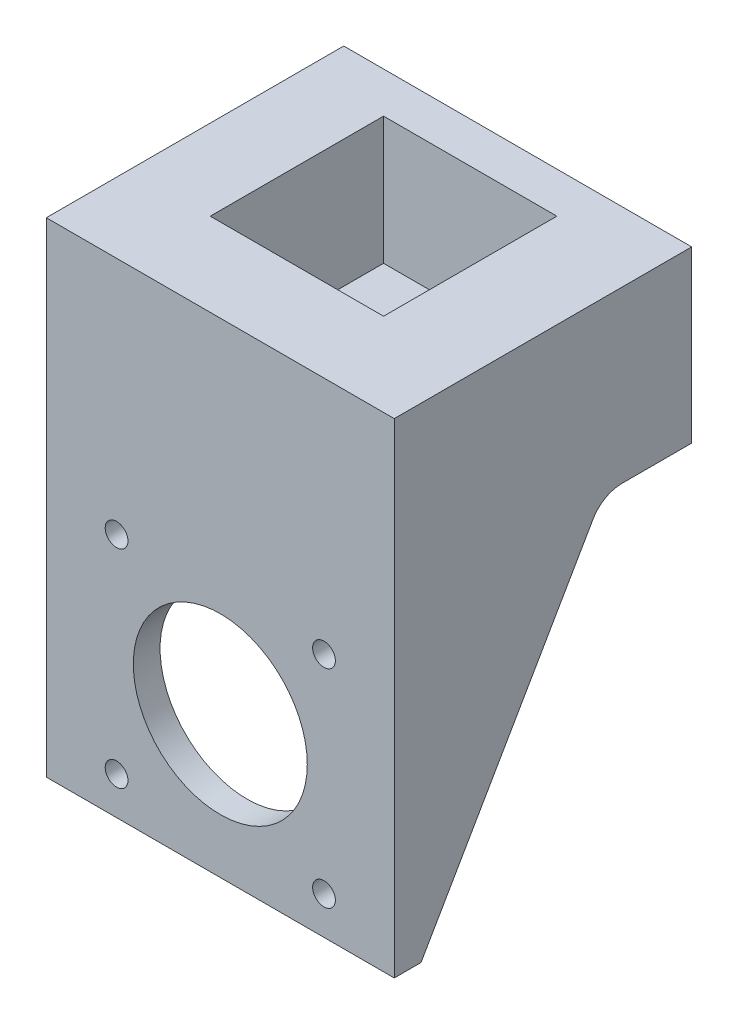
ISO-10303-21;
HEADER;
FILE_DESCRIPTION(('STEP AP214'),'2;1');
FILE_NAME('part.step','',(''),(''),'','','');
FILE_SCHEMA(('AUTOMOTIVE_DESIGN { 1 0 10303 214 1 1 1 1 }'));
ENDSEC;
DATA;
#1=APPLICATION_CONTEXT('core data for automotive mechanical design processes');
#2=APPLICATION_PROTOCOL_DEFINITION('international standard','automotive_design',2000,#1);
#3=PRODUCT_CONTEXT('',#1,'mechanical');
#4=PRODUCT('Part','Part','',(#3));
#5=PRODUCT_RELATED_PRODUCT_CATEGORY('part','',(#4));
#6=PRODUCT_DEFINITION_FORMATION('','',#4);
#7=PRODUCT_DEFINITION_CONTEXT('part definition',#1,'design');
#8=PRODUCT_DEFINITION('design','',#6,#7);
#9=PRODUCT_DEFINITION_SHAPE('','',#8);
#10=(LENGTH_UNIT() NAMED_UNIT(*) SI_UNIT(.MILLI.,.METRE.));
#11=(NAMED_UNIT(*) PLANE_ANGLE_UNIT() SI_UNIT($,.RADIAN.));
#12=(NAMED_UNIT(*) SI_UNIT($,.STERADIAN.) SOLID_ANGLE_UNIT());
#13=UNCERTAINTY_MEASURE_WITH_UNIT(LENGTH_MEASURE(1.E-05),#10,'distance_accuracy_value','');
#14=(GEOMETRIC_REPRESENTATION_CONTEXT(3) GLOBAL_UNCERTAINTY_ASSIGNED_CONTEXT((#13)) GLOBAL_UNIT_ASSIGNED_CONTEXT((#10,
#11,#12)) REPRESENTATION_CONTEXT('',''));
#15=CARTESIAN_POINT('',(0.,0.,0.));
#16=DIRECTION('',(0.,0.,1.));
#17=DIRECTION('',(1.,0.,0.));
#18=AXIS2_PLACEMENT_3D('',#15,#16,#17);
#19=CARTESIAN_POINT('',(-41.91,-12.7,6.35));
#20=DIRECTION('',(0.,1.,0.));
#21=DIRECTION('',(0.,0.,1.));
#22=AXIS2_PLACEMENT_3D('',#19,#20,#21);
#23=PLANE('',#22);
#24=CARTESIAN_POINT('',(-0.999999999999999,-12.7,25.4));
#25=DIRECTION('',(0.,1.,0.));
#26=DIRECTION('',(0.,0.,1.));
#27=AXIS2_PLACEMENT_3D('',#24,#25,#26);
#28=CIRCLE('',#27,3.429);
#29=CARTESIAN_POINT('',(-0.999999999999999,-12.7,28.829));
#30=VERTEX_POINT('',#29);
#31=EDGE_CURVE('E205',#30,#30,#28,.T.);
#32=ORIENTED_EDGE('',*,*,#31,.T.);
#33=EDGE_LOOP('',(#32));
#34=FACE_BOUND('',#33,.T.);
#35=DIRECTION('',(0.,0.,-1.));
#36=VECTOR('',#35,1.);
#37=CARTESIAN_POINT('',(-23.,-12.7,46.8));
#38=LINE('',#37,#36);
#39=CARTESIAN_POINT('',(-23.,-12.7,46.8));
#40=VERTEX_POINT('',#39);
#41=CARTESIAN_POINT('',(-23.,-12.7,16.7777860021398));
#42=VERTEX_POINT('',#41);
#43=EDGE_CURVE('E198',#40,#42,#38,.T.);
#44=ORIENTED_EDGE('',*,*,#43,.T.);
#45=DIRECTION('',(-1.,0.,0.));
#46=VECTOR('',#45,1.);
#47=CARTESIAN_POINT('',(-41.91,-12.7,16.7777860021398));
#48=LINE('',#47,#46);
#49=CARTESIAN_POINT('',(-26.,-12.7,16.7777860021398));
#50=VERTEX_POINT('',#49);
#51=EDGE_CURVE('E290',#42,#50,#48,.T.);
#52=ORIENTED_EDGE('',*,*,#51,.T.);
#53=DIRECTION('',(0.,0.,-1.));
#54=VECTOR('',#53,1.);
#55=CARTESIAN_POINT('',(-26.,-12.7,50.8));
#56=LINE('',#55,#54);
#57=CARTESIAN_POINT('',(-26.,-12.7,6.35));
#58=VERTEX_POINT('',#57);
#59=EDGE_CURVE('E256',#50,#58,#56,.T.);
#60=ORIENTED_EDGE('',*,*,#59,.T.);
#61=DIRECTION('',(1.,0.,0.));
#62=VECTOR('',#61,1.);
#63=CARTESIAN_POINT('',(22.1752021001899,-12.7,6.35));
#64=LINE('',#63,#62);
#65=CARTESIAN_POINT('',(26.,-12.7,6.35));
#66=VERTEX_POINT('',#65);
#67=EDGE_CURVE('E201',#58,#66,#64,.T.);
#68=ORIENTED_EDGE('',*,*,#67,.T.);
#69=DIRECTION('',(0.,0.,-1.));
#70=VECTOR('',#69,1.);
#71=CARTESIAN_POINT('',(26.,-12.7,50.8));
#72=LINE('',#71,#70);
#73=CARTESIAN_POINT('',(26.,-12.7,16.7777860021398));
#74=VERTEX_POINT('',#73);
#75=EDGE_CURVE('E251',#74,#66,#72,.T.);
#76=ORIENTED_EDGE('',*,*,#75,.F.);
#77=DIRECTION('',(1.,0.,0.));
#78=VECTOR('',#77,1.);
#79=CARTESIAN_POINT('',(-41.91,-12.7,16.7777860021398));
#80=LINE('',#79,#78);
#81=CARTESIAN_POINT('',(23.,-12.7,16.7777860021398));
#82=VERTEX_POINT('',#81);
#83=EDGE_CURVE('E284',#74,#82,#80,.F.);
#84=ORIENTED_EDGE('',*,*,#83,.T.);
#85=DIRECTION('',(0.,0.,1.));
#86=VECTOR('',#85,1.);
#87=CARTESIAN_POINT('',(23.,-12.7,19.664537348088));
#88=LINE('',#87,#86);
#89=CARTESIAN_POINT('',(23.,-12.7,46.8));
#90=VERTEX_POINT('',#89);
#91=EDGE_CURVE('E162',#82,#90,#88,.T.);
#92=ORIENTED_EDGE('',*,*,#91,.T.);
#93=DIRECTION('',(1.,0.,0.));
#94=VECTOR('',#93,1.);
#95=CARTESIAN_POINT('',(-26.,-12.7,46.8));
#96=LINE('',#95,#94);
#97=EDGE_CURVE('E180',#40,#90,#96,.T.);
#98=ORIENTED_EDGE('',*,*,#97,.F.);
#99=EDGE_LOOP('',(#44,#52,#60,#68,#76,#84,#92,#98));
#100=FACE_BOUND('',#99,.T.);
#101=ADVANCED_FACE('F43',(#34,#100),#23,.F.);
#102=CARTESIAN_POINT('',(-41.91,12.7,6.35));
#103=DIRECTION('',(0.,-1.,0.));
#104=DIRECTION('',(0.,0.,-1.));
#105=AXIS2_PLACEMENT_3D('',#102,#103,#104);
#106=PLANE('',#105);
#107=DIRECTION('',(-1.,0.,0.));
#108=VECTOR('',#107,1.);
#109=CARTESIAN_POINT('',(-13.95,12.7,12.45));
#110=LINE('',#109,#108);
#111=CARTESIAN_POINT('',(11.95,12.7,12.45));
#112=VERTEX_POINT('',#111);
#113=CARTESIAN_POINT('',(-13.95,12.7,12.45));
#114=VERTEX_POINT('',#113);
#115=EDGE_CURVE('E226',#112,#114,#110,.T.);
#116=ORIENTED_EDGE('',*,*,#115,.F.);
#117=DIRECTION('',(0.,0.,-1.));
#118=VECTOR('',#117,1.);
#119=CARTESIAN_POINT('',(11.95,12.7,38.35));
#120=LINE('',#119,#118);
#121=CARTESIAN_POINT('',(11.95,12.7,38.35));
#122=VERTEX_POINT('',#121);
#123=EDGE_CURVE('E208',#122,#112,#120,.T.);
#124=ORIENTED_EDGE('',*,*,#123,.F.);
#125=DIRECTION('',(1.,0.,0.));
#126=VECTOR('',#125,1.);
#127=CARTESIAN_POINT('',(-13.95,12.7,38.35));
#128=LINE('',#127,#126);
#129=CARTESIAN_POINT('',(-13.95,12.7,38.35));
#130=VERTEX_POINT('',#129);
#131=EDGE_CURVE('E215',#130,#122,#128,.T.);
#132=ORIENTED_EDGE('',*,*,#131,.F.);
#133=DIRECTION('',(0.,0.,1.));
#134=VECTOR('',#133,1.);
#135=CARTESIAN_POINT('',(-13.95,12.7,38.35));
#136=LINE('',#135,#134);
#137=EDGE_CURVE('E229',#114,#130,#136,.T.);
#138=ORIENTED_EDGE('',*,*,#137,.F.);
#139=EDGE_LOOP('',(#116,#124,#132,#138));
#140=FACE_BOUND('',#139,.T.);
#141=DIRECTION('',(0.,0.,-1.));
#142=VECTOR('',#141,1.);
#143=CARTESIAN_POINT('',(26.,12.7,50.8));
#144=LINE('',#143,#142);
#145=CARTESIAN_POINT('',(26.,12.7,50.8));
#146=VERTEX_POINT('',#145);
#147=CARTESIAN_POINT('',(26.,12.7,6.35));
#148=VERTEX_POINT('',#147);
#149=EDGE_CURVE('E261',#146,#148,#144,.T.);
#150=ORIENTED_EDGE('',*,*,#149,.T.);
#151=DIRECTION('',(-1.,0.,0.));
#152=VECTOR('',#151,1.);
#153=CARTESIAN_POINT('',(41.91,12.7,6.35));
#154=LINE('',#153,#152);
#155=CARTESIAN_POINT('',(-26.,12.7,6.35));
#156=VERTEX_POINT('',#155);
#157=EDGE_CURVE('E196',#148,#156,#154,.T.);
#158=ORIENTED_EDGE('',*,*,#157,.T.);
#159=DIRECTION('',(0.,0.,-1.));
#160=VECTOR('',#159,1.);
#161=CARTESIAN_POINT('',(-26.,12.7,50.8));
#162=LINE('',#161,#160);
#163=CARTESIAN_POINT('',(-26.,12.7,50.8));
#164=VERTEX_POINT('',#163);
#165=EDGE_CURVE('E258',#164,#156,#162,.T.);
#166=ORIENTED_EDGE('',*,*,#165,.F.);
#167=DIRECTION('',(-1.,0.,0.));
#168=VECTOR('',#167,1.);
#169=CARTESIAN_POINT('',(-26.,12.7,50.8));
#170=LINE('',#169,#168);
#171=EDGE_CURVE('E246',#146,#164,#170,.T.);
#172=ORIENTED_EDGE('',*,*,#171,.F.);
#173=EDGE_LOOP('',(#150,#158,#166,#172));
#174=FACE_BOUND('',#173,.T.);
#175=ADVANCED_FACE('F336',(#140,#174),#106,.F.);
#176=CARTESIAN_POINT('',(26.,-12.7,50.8));
#177=DIRECTION('',(-1.,0.,0.));
#178=DIRECTION('',(0.,0.,1.));
#179=AXIS2_PLACEMENT_3D('',#176,#177,#178);
#180=PLANE('',#179);
#181=DIRECTION('',(0.,0.866025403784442,-0.499999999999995));
#182=VECTOR('',#181,1.);
#183=CARTESIAN_POINT('',(26.,-59.7,46.8));
#184=LINE('',#183,#182);
#185=CARTESIAN_POINT('',(26.,-59.7,46.8));
#186=VERTEX_POINT('',#185);
#187=CARTESIAN_POINT('',(26.,-15.2,21.107913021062));
#188=VERTEX_POINT('',#187);
#189=EDGE_CURVE('E156',#186,#188,#184,.T.);
#190=ORIENTED_EDGE('',*,*,#189,.T.);
#191=CARTESIAN_POINT('',(26.,-17.7,16.7777860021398));
#192=DIRECTION('',(-1.,0.,0.));
#193=DIRECTION('',(0.,0.,1.));
#194=AXIS2_PLACEMENT_3D('',#191,#192,#193);
#195=CIRCLE('',#194,5.);
#196=EDGE_CURVE('E287',#188,#74,#195,.T.);
#197=ORIENTED_EDGE('',*,*,#196,.T.);
#198=ORIENTED_EDGE('',*,*,#75,.T.);
#199=DIRECTION('',(0.,1.,0.));
#200=VECTOR('',#199,1.);
#201=CARTESIAN_POINT('',(26.,-12.7,6.35));
#202=LINE('',#201,#200);
#203=EDGE_CURVE('E236',#66,#148,#202,.T.);
#204=ORIENTED_EDGE('',*,*,#203,.T.);
#205=ORIENTED_EDGE('',*,*,#149,.F.);
#206=DIRECTION('',(0.,1.,0.));
#207=VECTOR('',#206,1.);
#208=CARTESIAN_POINT('',(26.,-12.7,50.8));
#209=LINE('',#208,#207);
#210=CARTESIAN_POINT('',(26.,-59.7,50.8));
#211=VERTEX_POINT('',#210);
#212=EDGE_CURVE('E243',#211,#146,#209,.T.);
#213=ORIENTED_EDGE('',*,*,#212,.F.);
#214=DIRECTION('',(0.,0.,1.));
#215=VECTOR('',#214,1.);
#216=CARTESIAN_POINT('',(26.,-59.7,50.8));
#217=LINE('',#216,#215);
#218=EDGE_CURVE('E188',#186,#211,#217,.T.);
#219=ORIENTED_EDGE('',*,*,#218,.F.);
#220=EDGE_LOOP('',(#190,#197,#198,#204,#205,#213,#219));
#221=FACE_BOUND('',#220,.T.);
#222=ADVANCED_FACE('F310',(#221),#180,.F.);
#223=CARTESIAN_POINT('',(-26.,-12.7,50.8));
#224=DIRECTION('',(1.,0.,0.));
#225=DIRECTION('',(0.,0.,-1.));
#226=AXIS2_PLACEMENT_3D('',#223,#224,#225);
#227=PLANE('',#226);
#228=ORIENTED_EDGE('',*,*,#59,.F.);
#229=CARTESIAN_POINT('',(-26.,-17.7,16.7777860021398));
#230=DIRECTION('',(1.,0.,0.));
#231=DIRECTION('',(0.,0.,-1.));
#232=AXIS2_PLACEMENT_3D('',#229,#230,#231);
#233=CIRCLE('',#232,5.);
#234=CARTESIAN_POINT('',(-26.,-15.2,21.107913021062));
#235=VERTEX_POINT('',#234);
#236=EDGE_CURVE('E51',#50,#235,#233,.T.);
#237=ORIENTED_EDGE('',*,*,#236,.T.);
#238=DIRECTION('',(0.,-0.866025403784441,0.499999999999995));
#239=VECTOR('',#238,1.);
#240=CARTESIAN_POINT('',(-26.,-12.7,19.664537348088));
#241=LINE('',#240,#239);
#242=CARTESIAN_POINT('',(-26.,-59.7,46.8));
#243=VERTEX_POINT('',#242);
#244=EDGE_CURVE('E278',#235,#243,#241,.T.);
#245=ORIENTED_EDGE('',*,*,#244,.T.);
#246=DIRECTION('',(0.,0.,-1.));
#247=VECTOR('',#246,1.);
#248=CARTESIAN_POINT('',(-26.,-59.7,50.8));
#249=LINE('',#248,#247);
#250=CARTESIAN_POINT('',(-26.,-59.7,50.8));
#251=VERTEX_POINT('',#250);
#252=EDGE_CURVE('E186',#251,#243,#249,.T.);
#253=ORIENTED_EDGE('',*,*,#252,.F.);
#254=DIRECTION('',(0.,-1.,0.));
#255=VECTOR('',#254,1.);
#256=CARTESIAN_POINT('',(-26.,-12.7,50.8));
#257=LINE('',#256,#255);
#258=EDGE_CURVE('E249',#164,#251,#257,.T.);
#259=ORIENTED_EDGE('',*,*,#258,.F.);
#260=ORIENTED_EDGE('',*,*,#165,.T.);
#261=DIRECTION('',(0.,-1.,0.));
#262=VECTOR('',#261,1.);
#263=CARTESIAN_POINT('',(-26.,-12.7,6.35));
#264=LINE('',#263,#262);
#265=EDGE_CURVE('E247',#156,#58,#264,.T.);
#266=ORIENTED_EDGE('',*,*,#265,.T.);
#267=EDGE_LOOP('',(#228,#237,#245,#253,#259,#260,#266));
#268=FACE_BOUND('',#267,.T.);
#269=ADVANCED_FACE('F297',(#268),#227,.F.);
#270=CARTESIAN_POINT('',(0.,0.,50.8));
#271=DIRECTION('',(0.,0.,-1.));
#272=DIRECTION('',(-1.,0.,0.));
#273=AXIS2_PLACEMENT_3D('',#270,#271,#272);
#274=PLANE('',#273);
#275=CARTESIAN_POINT('',(0.,-38.55,50.8));
#276=DIRECTION('',(0.,0.,1.));
#277=DIRECTION('',(1.,0.,0.));
#278=AXIS2_PLACEMENT_3D('',#275,#276,#277);
#279=CIRCLE('',#278,13.);
#280=CARTESIAN_POINT('',(13.,-38.55,50.8));
#281=VERTEX_POINT('',#280);
#282=EDGE_CURVE('E282',#281,#281,#279,.T.);
#283=ORIENTED_EDGE('',*,*,#282,.F.);
#284=EDGE_LOOP('',(#283));
#285=FACE_BOUND('',#284,.T.);
#286=CARTESIAN_POINT('',(-15.5,-23.05,50.8));
#287=DIRECTION('',(0.,0.,1.));
#288=DIRECTION('',(1.,0.,0.));
#289=AXIS2_PLACEMENT_3D('',#286,#287,#288);
#290=CIRCLE('',#289,1.7);
#291=CARTESIAN_POINT('',(-13.8,-23.05,50.8));
#292=VERTEX_POINT('',#291);
#293=EDGE_CURVE('E317',#292,#292,#290,.T.);
#294=ORIENTED_EDGE('',*,*,#293,.F.);
#295=EDGE_LOOP('',(#294));
#296=FACE_BOUND('',#295,.T.);
#297=CARTESIAN_POINT('',(15.5,-54.05,50.8));
#298=DIRECTION('',(0.,0.,1.));
#299=DIRECTION('',(-1.,0.,0.));
#300=AXIS2_PLACEMENT_3D('',#297,#298,#299);
#301=CIRCLE('',#300,1.7);
#302=CARTESIAN_POINT('',(13.8,-54.05,50.8));
#303=VERTEX_POINT('',#302);
#304=EDGE_CURVE('E316',#303,#303,#301,.T.);
#305=ORIENTED_EDGE('',*,*,#304,.F.);
#306=EDGE_LOOP('',(#305));
#307=FACE_BOUND('',#306,.T.);
#308=CARTESIAN_POINT('',(15.5,-23.05,50.8));
#309=DIRECTION('',(0.,0.,1.));
#310=DIRECTION('',(-1.,0.,0.));
#311=AXIS2_PLACEMENT_3D('',#308,#309,#310);
#312=CIRCLE('',#311,1.7);
#313=CARTESIAN_POINT('',(13.8,-23.05,50.8));
#314=VERTEX_POINT('',#313);
#315=EDGE_CURVE('E161',#314,#314,#312,.T.);
#316=ORIENTED_EDGE('',*,*,#315,.F.);
#317=EDGE_LOOP('',(#316));
#318=FACE_BOUND('',#317,.T.);
#319=CARTESIAN_POINT('',(-15.5,-54.05,50.8));
#320=DIRECTION('',(0.,0.,1.));
#321=DIRECTION('',(1.,0.,0.));
#322=AXIS2_PLACEMENT_3D('',#319,#320,#321);
#323=CIRCLE('',#322,1.7);
#324=CARTESIAN_POINT('',(-13.8,-54.05,50.8));
#325=VERTEX_POINT('',#324);
#326=EDGE_CURVE('E269',#325,#325,#323,.T.);
#327=ORIENTED_EDGE('',*,*,#326,.F.);
#328=EDGE_LOOP('',(#327));
#329=FACE_BOUND('',#328,.T.);
#330=ORIENTED_EDGE('',*,*,#212,.T.);
#331=ORIENTED_EDGE('',*,*,#171,.T.);
#332=ORIENTED_EDGE('',*,*,#258,.T.);
#333=DIRECTION('',(-1.,0.,0.));
#334=VECTOR('',#333,1.);
#335=CARTESIAN_POINT('',(-26.,-59.7,50.8));
#336=LINE('',#335,#334);
#337=EDGE_CURVE('E193',#211,#251,#336,.T.);
#338=ORIENTED_EDGE('',*,*,#337,.F.);
#339=EDGE_LOOP('',(#330,#331,#332,#338));
#340=FACE_BOUND('',#339,.T.);
#341=ADVANCED_FACE('F333',(#285,#296,#307,#318,#329,#340),#274,.F.);
#342=CARTESIAN_POINT('',(11.95,-6.35,38.35));
#343=DIRECTION('',(1.,0.,0.));
#344=DIRECTION('',(0.,0.,-1.));
#345=AXIS2_PLACEMENT_3D('',#342,#343,#344);
#346=PLANE('',#345);
#347=ORIENTED_EDGE('',*,*,#123,.T.);
#348=DIRECTION('',(0.,1.,0.));
#349=VECTOR('',#348,1.);
#350=CARTESIAN_POINT('',(11.95,-6.35,12.45));
#351=LINE('',#350,#349);
#352=CARTESIAN_POINT('',(11.95,-6.35,12.45));
#353=VERTEX_POINT('',#352);
#354=EDGE_CURVE('E224',#353,#112,#351,.T.);
#355=ORIENTED_EDGE('',*,*,#354,.F.);
#356=DIRECTION('',(0.,0.,-1.));
#357=VECTOR('',#356,1.);
#358=CARTESIAN_POINT('',(11.95,-6.35,38.35));
#359=LINE('',#358,#357);
#360=CARTESIAN_POINT('',(11.95,-6.35,38.35));
#361=VERTEX_POINT('',#360);
#362=EDGE_CURVE('E211',#361,#353,#359,.T.);
#363=ORIENTED_EDGE('',*,*,#362,.F.);
#364=DIRECTION('',(0.,1.,0.));
#365=VECTOR('',#364,1.);
#366=CARTESIAN_POINT('',(11.95,-6.35,38.35));
#367=LINE('',#366,#365);
#368=EDGE_CURVE('E234',#361,#122,#367,.T.);
#369=ORIENTED_EDGE('',*,*,#368,.T.);
#370=EDGE_LOOP('',(#347,#355,#363,#369));
#371=FACE_BOUND('',#370,.T.);
#372=ADVANCED_FACE('F407',(#371),#346,.F.);
#373=CARTESIAN_POINT('',(-13.95,-6.35,38.35));
#374=DIRECTION('',(0.,0.,1.));
#375=DIRECTION('',(1.,0.,0.));
#376=AXIS2_PLACEMENT_3D('',#373,#374,#375);
#377=PLANE('',#376);
#378=ORIENTED_EDGE('',*,*,#131,.T.);
#379=ORIENTED_EDGE('',*,*,#368,.F.);
#380=DIRECTION('',(1.,0.,0.));
#381=VECTOR('',#380,1.);
#382=CARTESIAN_POINT('',(-13.95,-6.35,38.35));
#383=LINE('',#382,#381);
#384=CARTESIAN_POINT('',(-13.95,-6.35,38.35));
#385=VERTEX_POINT('',#384);
#386=EDGE_CURVE('E221',#385,#361,#383,.T.);
#387=ORIENTED_EDGE('',*,*,#386,.F.);
#388=DIRECTION('',(0.,1.,0.));
#389=VECTOR('',#388,1.);
#390=CARTESIAN_POINT('',(-13.95,-6.35,38.35));
#391=LINE('',#390,#389);
#392=EDGE_CURVE('E237',#385,#130,#391,.T.);
#393=ORIENTED_EDGE('',*,*,#392,.T.);
#394=EDGE_LOOP('',(#378,#379,#387,#393));
#395=FACE_BOUND('',#394,.T.);
#396=ADVANCED_FACE('F403',(#395),#377,.F.);
#397=CARTESIAN_POINT('',(-13.95,-6.35,38.35));
#398=DIRECTION('',(-1.,0.,0.));
#399=DIRECTION('',(0.,0.,1.));
#400=AXIS2_PLACEMENT_3D('',#397,#398,#399);
#401=PLANE('',#400);
#402=ORIENTED_EDGE('',*,*,#137,.T.);
#403=ORIENTED_EDGE('',*,*,#392,.F.);
#404=DIRECTION('',(0.,0.,1.));
#405=VECTOR('',#404,1.);
#406=CARTESIAN_POINT('',(-13.95,-6.35,38.35));
#407=LINE('',#406,#405);
#408=CARTESIAN_POINT('',(-13.95,-6.35,12.45));
#409=VERTEX_POINT('',#408);
#410=EDGE_CURVE('E218',#409,#385,#407,.T.);
#411=ORIENTED_EDGE('',*,*,#410,.F.);
#412=DIRECTION('',(0.,1.,0.));
#413=VECTOR('',#412,1.);
#414=CARTESIAN_POINT('',(-13.95,-6.35,12.45));
#415=LINE('',#414,#413);
#416=EDGE_CURVE('E239',#409,#114,#415,.T.);
#417=ORIENTED_EDGE('',*,*,#416,.T.);
#418=EDGE_LOOP('',(#402,#403,#411,#417));
#419=FACE_BOUND('',#418,.T.);
#420=ADVANCED_FACE('F406',(#419),#401,.F.);
#421=CARTESIAN_POINT('',(-13.95,-6.35,12.45));
#422=DIRECTION('',(0.,0.,-1.));
#423=DIRECTION('',(-1.,0.,0.));
#424=AXIS2_PLACEMENT_3D('',#421,#422,#423);
#425=PLANE('',#424);
#426=ORIENTED_EDGE('',*,*,#115,.T.);
#427=ORIENTED_EDGE('',*,*,#416,.F.);
#428=DIRECTION('',(-1.,0.,0.));
#429=VECTOR('',#428,1.);
#430=CARTESIAN_POINT('',(-13.95,-6.35,12.45));
#431=LINE('',#430,#429);
#432=EDGE_CURVE('E214',#353,#409,#431,.T.);
#433=ORIENTED_EDGE('',*,*,#432,.F.);
#434=ORIENTED_EDGE('',*,*,#354,.T.);
#435=EDGE_LOOP('',(#426,#427,#433,#434));
#436=FACE_BOUND('',#435,.T.);
#437=ADVANCED_FACE('F401',(#436),#425,.F.);
#438=CARTESIAN_POINT('',(0.,-6.35,0.));
#439=DIRECTION('',(0.,-1.,0.));
#440=DIRECTION('',(0.,0.,-1.));
#441=AXIS2_PLACEMENT_3D('',#438,#439,#440);
#442=PLANE('',#441);
#443=CARTESIAN_POINT('',(-0.999999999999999,-6.35,25.4));
#444=DIRECTION('',(0.,1.,0.));
#445=DIRECTION('',(0.,0.,1.));
#446=AXIS2_PLACEMENT_3D('',#443,#444,#445);
#447=CIRCLE('',#446,3.429);
#448=CARTESIAN_POINT('',(-0.999999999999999,-6.35,28.829));
#449=VERTEX_POINT('',#448);
#450=EDGE_CURVE('E204',#449,#449,#447,.T.);
#451=ORIENTED_EDGE('',*,*,#450,.F.);
#452=EDGE_LOOP('',(#451));
#453=FACE_BOUND('',#452,.T.);
#454=ORIENTED_EDGE('',*,*,#362,.T.);
#455=ORIENTED_EDGE('',*,*,#432,.T.);
#456=ORIENTED_EDGE('',*,*,#410,.T.);
#457=ORIENTED_EDGE('',*,*,#386,.T.);
#458=EDGE_LOOP('',(#454,#455,#456,#457));
#459=FACE_BOUND('',#458,.T.);
#460=ADVANCED_FACE('F397',(#453,#459),#442,.F.);
#461=CARTESIAN_POINT('',(-0.999999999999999,-12.7,25.4));
#462=DIRECTION('',(0.,1.,0.));
#463=DIRECTION('',(0.,0.,1.));
#464=AXIS2_PLACEMENT_3D('',#461,#462,#463);
#465=CYLINDRICAL_SURFACE('',#464,3.429);
#466=ORIENTED_EDGE('',*,*,#31,.F.);
#467=EDGE_LOOP('',(#466));
#468=FACE_BOUND('',#467,.T.);
#469=ORIENTED_EDGE('',*,*,#450,.T.);
#470=EDGE_LOOP('',(#469));
#471=FACE_BOUND('',#470,.T.);
#472=ADVANCED_FACE('F395',(#468,#471),#465,.F.);
#473=CARTESIAN_POINT('',(-41.91,7.62,6.35));
#474=DIRECTION('',(0.,0.,1.));
#475=DIRECTION('',(1.,0.,0.));
#476=AXIS2_PLACEMENT_3D('',#473,#474,#475);
#477=PLANE('',#476);
#478=ORIENTED_EDGE('',*,*,#157,.F.);
#479=ORIENTED_EDGE('',*,*,#203,.F.);
#480=ORIENTED_EDGE('',*,*,#67,.F.);
#481=ORIENTED_EDGE('',*,*,#265,.F.);
#482=EDGE_LOOP('',(#478,#479,#480,#481));
#483=FACE_BOUND('',#482,.T.);
#484=ADVANCED_FACE('F304',(#483),#477,.F.);
#485=CARTESIAN_POINT('',(-26.,-59.7,46.8));
#486=DIRECTION('',(0.,0.,1.));
#487=DIRECTION('',(1.,0.,0.));
#488=AXIS2_PLACEMENT_3D('',#485,#486,#487);
#489=PLANE('',#488);
#490=CARTESIAN_POINT('',(0.,-38.55,46.8));
#491=DIRECTION('',(0.,0.,1.));
#492=DIRECTION('',(1.,0.,0.));
#493=AXIS2_PLACEMENT_3D('',#490,#491,#492);
#494=CIRCLE('',#493,13.);
#495=CARTESIAN_POINT('',(13.,-38.55,46.8));
#496=VERTEX_POINT('',#495);
#497=EDGE_CURVE('E279',#496,#496,#494,.T.);
#498=ORIENTED_EDGE('',*,*,#497,.T.);
#499=EDGE_LOOP('',(#498));
#500=FACE_BOUND('',#499,.T.);
#501=CARTESIAN_POINT('',(-15.5,-23.05,46.8));
#502=DIRECTION('',(0.,0.,1.));
#503=DIRECTION('',(1.,0.,0.));
#504=AXIS2_PLACEMENT_3D('',#501,#502,#503);
#505=CIRCLE('',#504,1.7);
#506=CARTESIAN_POINT('',(-13.8,-23.05,46.8));
#507=VERTEX_POINT('',#506);
#508=EDGE_CURVE('E275',#507,#507,#505,.T.);
#509=ORIENTED_EDGE('',*,*,#508,.T.);
#510=EDGE_LOOP('',(#509));
#511=FACE_BOUND('',#510,.T.);
#512=CARTESIAN_POINT('',(15.5,-54.05,46.8));
#513=DIRECTION('',(0.,0.,1.));
#514=DIRECTION('',(1.,0.,0.));
#515=AXIS2_PLACEMENT_3D('',#512,#513,#514);
#516=CIRCLE('',#515,1.7);
#517=CARTESIAN_POINT('',(17.2,-54.05,46.8));
#518=VERTEX_POINT('',#517);
#519=EDGE_CURVE('E272',#518,#518,#516,.T.);
#520=ORIENTED_EDGE('',*,*,#519,.T.);
#521=EDGE_LOOP('',(#520));
#522=FACE_BOUND('',#521,.T.);
#523=CARTESIAN_POINT('',(15.5,-23.05,46.8));
#524=DIRECTION('',(0.,0.,1.));
#525=DIRECTION('',(1.,0.,0.));
#526=AXIS2_PLACEMENT_3D('',#523,#524,#525);
#527=CIRCLE('',#526,1.7);
#528=CARTESIAN_POINT('',(17.2,-23.05,46.8));
#529=VERTEX_POINT('',#528);
#530=EDGE_CURVE('E268',#529,#529,#527,.T.);
#531=ORIENTED_EDGE('',*,*,#530,.T.);
#532=EDGE_LOOP('',(#531));
#533=FACE_BOUND('',#532,.T.);
#534=CARTESIAN_POINT('',(-15.5,-54.05,46.8));
#535=DIRECTION('',(0.,0.,1.));
#536=DIRECTION('',(1.,0.,0.));
#537=AXIS2_PLACEMENT_3D('',#534,#535,#536);
#538=CIRCLE('',#537,1.7);
#539=CARTESIAN_POINT('',(-13.8,-54.05,46.8));
#540=VERTEX_POINT('',#539);
#541=EDGE_CURVE('E265',#540,#540,#538,.T.);
#542=ORIENTED_EDGE('',*,*,#541,.T.);
#543=EDGE_LOOP('',(#542));
#544=FACE_BOUND('',#543,.T.);
#545=ORIENTED_EDGE('',*,*,#97,.T.);
#546=DIRECTION('',(0.,-1.,0.));
#547=VECTOR('',#546,1.);
#548=CARTESIAN_POINT('',(23.,-12.7,46.8));
#549=LINE('',#548,#547);
#550=CARTESIAN_POINT('',(23.,-59.7,46.8));
#551=VERTEX_POINT('',#550);
#552=EDGE_CURVE('E167',#90,#551,#549,.T.);
#553=ORIENTED_EDGE('',*,*,#552,.T.);
#554=DIRECTION('',(1.,0.,0.));
#555=VECTOR('',#554,1.);
#556=CARTESIAN_POINT('',(-26.,-59.7,46.8));
#557=LINE('',#556,#555);
#558=CARTESIAN_POINT('',(-23.,-59.7,46.8));
#559=VERTEX_POINT('',#558);
#560=EDGE_CURVE('E177',#559,#551,#557,.T.);
#561=ORIENTED_EDGE('',*,*,#560,.F.);
#562=DIRECTION('',(0.,1.,0.));
#563=VECTOR('',#562,1.);
#564=CARTESIAN_POINT('',(-23.,-59.7,46.8));
#565=LINE('',#564,#563);
#566=EDGE_CURVE('E326',#559,#40,#565,.T.);
#567=ORIENTED_EDGE('',*,*,#566,.T.);
#568=EDGE_LOOP('',(#545,#553,#561,#567));
#569=FACE_BOUND('',#568,.T.);
#570=ADVANCED_FACE('F175',(#500,#511,#522,#533,#544,#569),#489,.F.);
#571=CARTESIAN_POINT('',(0.,-59.7,0.));
#572=DIRECTION('',(0.,-1.,0.));
#573=DIRECTION('',(0.,0.,-1.));
#574=AXIS2_PLACEMENT_3D('',#571,#572,#573);
#575=PLANE('',#574);
#576=ORIENTED_EDGE('',*,*,#252,.T.);
#577=EDGE_CURVE('E185',#243,#559,#557,.T.);
#578=ORIENTED_EDGE('',*,*,#577,.T.);
#579=ORIENTED_EDGE('',*,*,#560,.T.);
#580=DIRECTION('',(1.,0.,0.));
#581=VECTOR('',#580,1.);
#582=CARTESIAN_POINT('',(23.,-59.7,46.8));
#583=LINE('',#582,#581);
#584=EDGE_CURVE('E149',#551,#186,#583,.T.);
#585=ORIENTED_EDGE('',*,*,#584,.T.);
#586=ORIENTED_EDGE('',*,*,#218,.T.);
#587=ORIENTED_EDGE('',*,*,#337,.T.);
#588=EDGE_LOOP('',(#576,#578,#579,#585,#586,#587));
#589=FACE_BOUND('',#588,.T.);
#590=ADVANCED_FACE('F183',(#589),#575,.T.);
#591=CARTESIAN_POINT('',(-23.,-12.7,19.664537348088));
#592=DIRECTION('',(0.,-0.499999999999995,-0.866025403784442));
#593=DIRECTION('',(0.,0.866025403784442,-0.499999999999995));
#594=AXIS2_PLACEMENT_3D('',#591,#592,#593);
#595=PLANE('',#594);
#596=ORIENTED_EDGE('',*,*,#244,.F.);
#597=DIRECTION('',(-1.,0.,0.));
#598=VECTOR('',#597,1.);
#599=CARTESIAN_POINT('',(-23.,-15.2,21.107913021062));
#600=LINE('',#599,#598);
#601=CARTESIAN_POINT('',(-23.,-15.2,21.107913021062));
#602=VERTEX_POINT('',#601);
#603=EDGE_CURVE('E58',#235,#602,#600,.F.);
#604=ORIENTED_EDGE('',*,*,#603,.T.);
#605=DIRECTION('',(0.,-0.866025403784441,0.499999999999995));
#606=VECTOR('',#605,1.);
#607=CARTESIAN_POINT('',(-23.,-12.7,19.664537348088));
#608=LINE('',#607,#606);
#609=EDGE_CURVE('E324',#602,#559,#608,.T.);
#610=ORIENTED_EDGE('',*,*,#609,.T.);
#611=ORIENTED_EDGE('',*,*,#577,.F.);
#612=EDGE_LOOP('',(#596,#604,#610,#611));
#613=FACE_BOUND('',#612,.T.);
#614=ADVANCED_FACE('F329',(#613),#595,.T.);
#615=CARTESIAN_POINT('',(-23.,0.,0.));
#616=DIRECTION('',(1.,0.,0.));
#617=DIRECTION('',(0.,0.,-1.));
#618=AXIS2_PLACEMENT_3D('',#615,#616,#617);
#619=PLANE('',#618);
#620=ORIENTED_EDGE('',*,*,#609,.F.);
#621=CARTESIAN_POINT('',(-23.,-17.7,16.7777860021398));
#622=DIRECTION('',(1.,0.,0.));
#623=DIRECTION('',(0.,0.,-1.));
#624=AXIS2_PLACEMENT_3D('',#621,#622,#623);
#625=CIRCLE('',#624,5.);
#626=EDGE_CURVE('E11',#602,#42,#625,.F.);
#627=ORIENTED_EDGE('',*,*,#626,.T.);
#628=ORIENTED_EDGE('',*,*,#43,.F.);
#629=ORIENTED_EDGE('',*,*,#566,.F.);
#630=EDGE_LOOP('',(#620,#627,#628,#629));
#631=FACE_BOUND('',#630,.T.);
#632=ADVANCED_FACE('F383',(#631),#619,.T.);
#633=CARTESIAN_POINT('',(-15.5,-54.05,6.35));
#634=DIRECTION('',(0.,0.,1.));
#635=DIRECTION('',(1.,0.,0.));
#636=AXIS2_PLACEMENT_3D('',#633,#634,#635);
#637=CYLINDRICAL_SURFACE('',#636,1.7);
#638=ORIENTED_EDGE('',*,*,#326,.T.);
#639=EDGE_LOOP('',(#638));
#640=FACE_BOUND('',#639,.T.);
#641=ORIENTED_EDGE('',*,*,#541,.F.);
#642=EDGE_LOOP('',(#641));
#643=FACE_BOUND('',#642,.T.);
#644=ADVANCED_FACE('F373',(#640,#643),#637,.F.);
#645=CARTESIAN_POINT('',(15.5,-23.05,6.35));
#646=DIRECTION('',(0.,0.,1.));
#647=DIRECTION('',(1.,0.,0.));
#648=AXIS2_PLACEMENT_3D('',#645,#646,#647);
#649=CYLINDRICAL_SURFACE('',#648,1.7);
#650=ORIENTED_EDGE('',*,*,#315,.T.);
#651=EDGE_LOOP('',(#650));
#652=FACE_BOUND('',#651,.T.);
#653=ORIENTED_EDGE('',*,*,#530,.F.);
#654=EDGE_LOOP('',(#653));
#655=FACE_BOUND('',#654,.T.);
#656=ADVANCED_FACE('F369',(#652,#655),#649,.F.);
#657=CARTESIAN_POINT('',(15.5,-54.05,6.35));
#658=DIRECTION('',(0.,0.,1.));
#659=DIRECTION('',(1.,0.,0.));
#660=AXIS2_PLACEMENT_3D('',#657,#658,#659);
#661=CYLINDRICAL_SURFACE('',#660,1.7);
#662=ORIENTED_EDGE('',*,*,#304,.T.);
#663=EDGE_LOOP('',(#662));
#664=FACE_BOUND('',#663,.T.);
#665=ORIENTED_EDGE('',*,*,#519,.F.);
#666=EDGE_LOOP('',(#665));
#667=FACE_BOUND('',#666,.T.);
#668=ADVANCED_FACE('F372',(#664,#667),#661,.F.);
#669=CARTESIAN_POINT('',(-15.5,-23.05,6.35));
#670=DIRECTION('',(0.,0.,1.));
#671=DIRECTION('',(1.,0.,0.));
#672=AXIS2_PLACEMENT_3D('',#669,#670,#671);
#673=CYLINDRICAL_SURFACE('',#672,1.7);
#674=ORIENTED_EDGE('',*,*,#293,.T.);
#675=EDGE_LOOP('',(#674));
#676=FACE_BOUND('',#675,.T.);
#677=ORIENTED_EDGE('',*,*,#508,.F.);
#678=EDGE_LOOP('',(#677));
#679=FACE_BOUND('',#678,.T.);
#680=ADVANCED_FACE('F368',(#676,#679),#673,.F.);
#681=CARTESIAN_POINT('',(23.,-59.7,46.8));
#682=DIRECTION('',(0.,-0.499999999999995,-0.866025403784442));
#683=DIRECTION('',(0.,0.866025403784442,-0.499999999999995));
#684=AXIS2_PLACEMENT_3D('',#681,#682,#683);
#685=PLANE('',#684);
#686=DIRECTION('',(0.,0.866025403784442,-0.499999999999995));
#687=VECTOR('',#686,1.);
#688=CARTESIAN_POINT('',(23.,-59.7,46.8));
#689=LINE('',#688,#687);
#690=CARTESIAN_POINT('',(23.,-15.2,21.107913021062));
#691=VERTEX_POINT('',#690);
#692=EDGE_CURVE('E153',#551,#691,#689,.T.);
#693=ORIENTED_EDGE('',*,*,#692,.T.);
#694=DIRECTION('',(1.,0.,0.));
#695=VECTOR('',#694,1.);
#696=CARTESIAN_POINT('',(23.,-15.2,21.107913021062));
#697=LINE('',#696,#695);
#698=EDGE_CURVE('E264',#691,#188,#697,.T.);
#699=ORIENTED_EDGE('',*,*,#698,.T.);
#700=ORIENTED_EDGE('',*,*,#189,.F.);
#701=ORIENTED_EDGE('',*,*,#584,.F.);
#702=EDGE_LOOP('',(#693,#699,#700,#701));
#703=FACE_BOUND('',#702,.T.);
#704=ADVANCED_FACE('F151',(#703),#685,.T.);
#705=CARTESIAN_POINT('',(23.,0.,0.));
#706=DIRECTION('',(-1.,0.,0.));
#707=DIRECTION('',(0.,0.,1.));
#708=AXIS2_PLACEMENT_3D('',#705,#706,#707);
#709=PLANE('',#708);
#710=ORIENTED_EDGE('',*,*,#552,.F.);
#711=ORIENTED_EDGE('',*,*,#91,.F.);
#712=CARTESIAN_POINT('',(23.,-17.7,16.7777860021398));
#713=DIRECTION('',(-1.,0.,0.));
#714=DIRECTION('',(0.,0.,1.));
#715=AXIS2_PLACEMENT_3D('',#712,#713,#714);
#716=CIRCLE('',#715,5.);
#717=EDGE_CURVE('E170',#82,#691,#716,.F.);
#718=ORIENTED_EDGE('',*,*,#717,.T.);
#719=ORIENTED_EDGE('',*,*,#692,.F.);
#720=EDGE_LOOP('',(#710,#711,#718,#719));
#721=FACE_BOUND('',#720,.T.);
#722=ADVANCED_FACE('F166',(#721),#709,.T.);
#723=CARTESIAN_POINT('',(0.,-38.55,6.35));
#724=DIRECTION('',(0.,0.,1.));
#725=DIRECTION('',(1.,0.,0.));
#726=AXIS2_PLACEMENT_3D('',#723,#724,#725);
#727=CYLINDRICAL_SURFACE('',#726,13.);
#728=ORIENTED_EDGE('',*,*,#282,.T.);
#729=EDGE_LOOP('',(#728));
#730=FACE_BOUND('',#729,.T.);
#731=ORIENTED_EDGE('',*,*,#497,.F.);
#732=EDGE_LOOP('',(#731));
#733=FACE_BOUND('',#732,.T.);
#734=ADVANCED_FACE('F351',(#730,#733),#727,.F.);
#735=CARTESIAN_POINT('',(23.,-17.7,16.7777860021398));
#736=DIRECTION('',(1.,0.,0.));
#737=DIRECTION('',(0.,0.,-1.));
#738=AXIS2_PLACEMENT_3D('',#735,#736,#737);
#739=CYLINDRICAL_SURFACE('',#738,5.);
#740=ORIENTED_EDGE('',*,*,#717,.F.);
#741=ORIENTED_EDGE('',*,*,#83,.F.);
#742=ORIENTED_EDGE('',*,*,#196,.F.);
#743=ORIENTED_EDGE('',*,*,#698,.F.);
#744=EDGE_LOOP('',(#740,#741,#742,#743));
#745=FACE_BOUND('',#744,.T.);
#746=ADVANCED_FACE('F309',(#745),#739,.F.);
#747=CARTESIAN_POINT('',(-41.91,-17.7,16.7777860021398));
#748=DIRECTION('',(-1.,0.,0.));
#749=DIRECTION('',(0.,0.,1.));
#750=AXIS2_PLACEMENT_3D('',#747,#748,#749);
#751=CYLINDRICAL_SURFACE('',#750,5.);
#752=ORIENTED_EDGE('',*,*,#626,.F.);
#753=ORIENTED_EDGE('',*,*,#603,.F.);
#754=ORIENTED_EDGE('',*,*,#236,.F.);
#755=ORIENTED_EDGE('',*,*,#51,.F.);
#756=EDGE_LOOP('',(#752,#753,#754,#755));
#757=FACE_BOUND('',#756,.T.);
#758=ADVANCED_FACE('F45',(#757),#751,.F.);
#759=CLOSED_SHELL('',(#101,#175,#222,#269,#341,#372,#396,#420,#437,#460,#472,#484,#570,#590,
#614,#632,#644,#656,#668,#680,#704,#722,#734,#746,#758));
#760=MANIFOLD_SOLID_BREP('B2',#759);
#761=ADVANCED_BREP_SHAPE_REPRESENTATION('',(#18,#760),#14);
#762=SHAPE_DEFINITION_REPRESENTATION(#9,#761);
ENDSEC;
END-ISO-10303-21;
